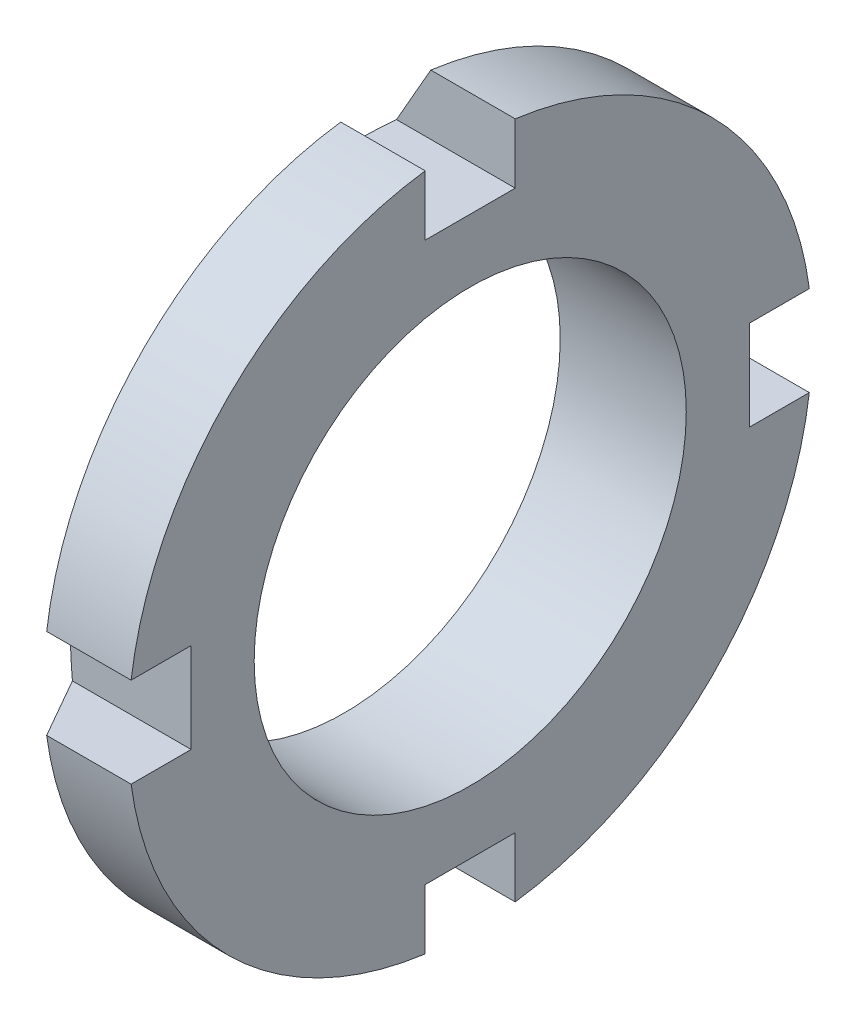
ISO-10303-21;
HEADER;
FILE_DESCRIPTION(('STEP AP214'),'2;1');
FILE_NAME('part.step','',(''),(''),'','','');
FILE_SCHEMA(('AUTOMOTIVE_DESIGN { 1 0 10303 214 1 1 1 1 }'));
ENDSEC;
DATA;
#1=APPLICATION_CONTEXT('core data for automotive mechanical design processes');
#2=APPLICATION_PROTOCOL_DEFINITION('international standard','automotive_design',2000,#1);
#3=PRODUCT_CONTEXT('',#1,'mechanical');
#4=PRODUCT('Part','Part','',(#3));
#5=PRODUCT_RELATED_PRODUCT_CATEGORY('part','',(#4));
#6=PRODUCT_DEFINITION_FORMATION('','',#4);
#7=PRODUCT_DEFINITION_CONTEXT('part definition',#1,'design');
#8=PRODUCT_DEFINITION('design','',#6,#7);
#9=PRODUCT_DEFINITION_SHAPE('','',#8);
#10=(LENGTH_UNIT() NAMED_UNIT(*) SI_UNIT(.MILLI.,.METRE.));
#11=(NAMED_UNIT(*) PLANE_ANGLE_UNIT() SI_UNIT($,.RADIAN.));
#12=(NAMED_UNIT(*) SI_UNIT($,.STERADIAN.) SOLID_ANGLE_UNIT());
#13=UNCERTAINTY_MEASURE_WITH_UNIT(LENGTH_MEASURE(1.E-05),#10,'distance_accuracy_value','');
#14=(GEOMETRIC_REPRESENTATION_CONTEXT(3) GLOBAL_UNCERTAINTY_ASSIGNED_CONTEXT((#13)) GLOBAL_UNIT_ASSIGNED_CONTEXT((#10,
#11,#12)) REPRESENTATION_CONTEXT('',''));
#15=CARTESIAN_POINT('',(0.,0.,0.));
#16=DIRECTION('',(0.,0.,1.));
#17=DIRECTION('',(1.,0.,0.));
#18=AXIS2_PLACEMENT_3D('',#15,#16,#17);
#19=CARTESIAN_POINT('',(-3.57298957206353,0.,0.));
#20=DIRECTION('',(-1.,0.,0.));
#21=DIRECTION('',(0.,0.,1.));
#22=AXIS2_PLACEMENT_3D('',#19,#20,#21);
#23=CYLINDRICAL_SURFACE('',#22,19.);
#24=CARTESIAN_POINT('',(2.30940107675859,0.,0.));
#25=DIRECTION('',(-1.,0.,0.));
#26=DIRECTION('',(0.,0.,1.));
#27=AXIS2_PLACEMENT_3D('',#24,#25,#26);
#28=CIRCLE('',#27,19.);
#29=CARTESIAN_POINT('',(2.30940107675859,-2.49999999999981,-18.8348082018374));
#30=VERTEX_POINT('',#29);
#31=CARTESIAN_POINT('',(2.30940107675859,-18.8348082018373,-2.50000000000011));
#32=VERTEX_POINT('',#31);
#33=EDGE_CURVE('E499',#30,#32,#28,.T.);
#34=ORIENTED_EDGE('',*,*,#33,.F.);
#35=DIRECTION('',(-1.,0.,0.));
#36=VECTOR('',#35,1.);
#37=CARTESIAN_POINT('',(-3.57298957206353,-2.49999999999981,-18.8348082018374));
#38=LINE('',#37,#36);
#39=CARTESIAN_POINT('',(6.9999999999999,-2.49999999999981,-18.8348082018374));
#40=VERTEX_POINT('',#39);
#41=EDGE_CURVE('E668',#30,#40,#38,.F.);
#42=ORIENTED_EDGE('',*,*,#41,.T.);
#43=CARTESIAN_POINT('',(6.9999999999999,0.,0.));
#44=DIRECTION('',(-1.,0.,0.));
#45=DIRECTION('',(0.,0.,1.));
#46=AXIS2_PLACEMENT_3D('',#43,#44,#45);
#47=CIRCLE('',#46,19.);
#48=CARTESIAN_POINT('',(6.9999999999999,-18.8348082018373,-2.50000000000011));
#49=VERTEX_POINT('',#48);
#50=EDGE_CURVE('E481',#40,#49,#47,.T.);
#51=ORIENTED_EDGE('',*,*,#50,.T.);
#52=DIRECTION('',(-1.,0.,0.));
#53=VECTOR('',#52,1.);
#54=CARTESIAN_POINT('',(-3.57298957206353,-18.8348082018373,-2.50000000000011));
#55=LINE('',#54,#53);
#56=EDGE_CURVE('E531',#49,#32,#55,.T.);
#57=ORIENTED_EDGE('',*,*,#56,.T.);
#58=EDGE_LOOP('',(#34,#42,#51,#57));
#59=FACE_BOUND('',#58,.T.);
#60=ADVANCED_FACE('F348',(#59),#23,.T.);
#61=CARTESIAN_POINT('',(2.30940107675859,-18.8348082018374,2.49999999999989));
#62=VERTEX_POINT('',#61);
#63=CARTESIAN_POINT('',(2.30940107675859,-2.50000000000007,18.8348082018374));
#64=VERTEX_POINT('',#63);
#65=EDGE_CURVE('E524',#62,#64,#28,.T.);
#66=ORIENTED_EDGE('',*,*,#65,.F.);
#67=DIRECTION('',(-1.,0.,0.));
#68=VECTOR('',#67,1.);
#69=CARTESIAN_POINT('',(-3.57298957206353,-18.8348082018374,2.49999999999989));
#70=LINE('',#69,#68);
#71=CARTESIAN_POINT('',(6.9999999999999,-18.8348082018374,2.49999999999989));
#72=VERTEX_POINT('',#71);
#73=EDGE_CURVE('E515',#62,#72,#70,.F.);
#74=ORIENTED_EDGE('',*,*,#73,.T.);
#75=CARTESIAN_POINT('',(6.9999999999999,-2.50000000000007,18.8348082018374));
#76=VERTEX_POINT('',#75);
#77=EDGE_CURVE('E486',#72,#76,#47,.T.);
#78=ORIENTED_EDGE('',*,*,#77,.T.);
#79=DIRECTION('',(-1.,0.,0.));
#80=VECTOR('',#79,1.);
#81=CARTESIAN_POINT('',(-3.57298957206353,-2.50000000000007,18.8348082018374));
#82=LINE('',#81,#80);
#83=EDGE_CURVE('E572',#76,#64,#82,.T.);
#84=ORIENTED_EDGE('',*,*,#83,.T.);
#85=EDGE_LOOP('',(#66,#74,#78,#84));
#86=FACE_BOUND('',#85,.T.);
#87=ADVANCED_FACE('F521',(#86),#23,.T.);
#88=CARTESIAN_POINT('',(2.30940107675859,2.49999999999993,18.8348082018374));
#89=VERTEX_POINT('',#88);
#90=CARTESIAN_POINT('',(2.30940107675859,18.8348082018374,2.5));
#91=VERTEX_POINT('',#90);
#92=EDGE_CURVE('E489',#89,#91,#28,.T.);
#93=ORIENTED_EDGE('',*,*,#92,.F.);
#94=DIRECTION('',(-1.,0.,0.));
#95=VECTOR('',#94,1.);
#96=CARTESIAN_POINT('',(-3.57298957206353,2.49999999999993,18.8348082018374));
#97=LINE('',#96,#95);
#98=CARTESIAN_POINT('',(6.9999999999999,2.49999999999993,18.8348082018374));
#99=VERTEX_POINT('',#98);
#100=EDGE_CURVE('E571',#89,#99,#97,.F.);
#101=ORIENTED_EDGE('',*,*,#100,.T.);
#102=CARTESIAN_POINT('',(6.9999999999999,18.8348082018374,2.5));
#103=VERTEX_POINT('',#102);
#104=EDGE_CURVE('E490',#99,#103,#47,.T.);
#105=ORIENTED_EDGE('',*,*,#104,.T.);
#106=DIRECTION('',(-1.,0.,0.));
#107=VECTOR('',#106,1.);
#108=CARTESIAN_POINT('',(-3.57298957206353,18.8348082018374,2.5));
#109=LINE('',#108,#107);
#110=EDGE_CURVE('E606',#103,#91,#109,.T.);
#111=ORIENTED_EDGE('',*,*,#110,.T.);
#112=EDGE_LOOP('',(#93,#101,#105,#111));
#113=FACE_BOUND('',#112,.T.);
#114=ADVANCED_FACE('F628',(#113),#23,.T.);
#115=CARTESIAN_POINT('',(0.,12.,0.));
#116=DIRECTION('',(1.,0.,0.));
#117=DIRECTION('',(0.,0.,-1.));
#118=AXIS2_PLACEMENT_3D('',#115,#116,#117);
#119=PLANE('',#118);
#120=CARTESIAN_POINT('',(0.,0.,0.));
#121=DIRECTION('',(-1.,0.,0.));
#122=DIRECTION('',(0.,0.,1.));
#123=AXIS2_PLACEMENT_3D('',#120,#121,#122);
#124=CIRCLE('',#123,12.);
#125=CARTESIAN_POINT('',(0.,0.,12.));
#126=VERTEX_POINT('',#125);
#127=EDGE_CURVE('E615',#126,#126,#124,.T.);
#128=ORIENTED_EDGE('',*,*,#127,.F.);
#129=EDGE_LOOP('',(#128));
#130=FACE_BOUND('',#129,.T.);
#131=CARTESIAN_POINT('',(0.,0.,0.));
#132=DIRECTION('',(-1.,0.,0.));
#133=DIRECTION('',(0.,0.,1.));
#134=AXIS2_PLACEMENT_3D('',#131,#132,#133);
#135=CIRCLE('',#134,15.);
#136=CARTESIAN_POINT('',(0.,0.,15.));
#137=VERTEX_POINT('',#136);
#138=EDGE_CURVE('E498',#137,#137,#135,.T.);
#139=ORIENTED_EDGE('',*,*,#138,.T.);
#140=EDGE_LOOP('',(#139));
#141=FACE_BOUND('',#140,.T.);
#142=ADVANCED_FACE('F350',(#130,#141),#119,.F.);
#143=CARTESIAN_POINT('',(2.30940107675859,0.,0.));
#144=DIRECTION('',(1.,0.,0.));
#145=DIRECTION('',(0.,0.,-1.));
#146=AXIS2_PLACEMENT_3D('',#143,#144,#145);
#147=CONICAL_SURFACE('',#146,19.,1.0471975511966);
#148=ORIENTED_EDGE('',*,*,#138,.F.);
#149=EDGE_LOOP('',(#148));
#150=FACE_BOUND('',#149,.T.);
#151=CARTESIAN_POINT('',(1.05418874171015,6.54684622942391,-15.4999999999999));
#152=CARTESIAN_POINT('',(0.975824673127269,6.19805511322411,-15.4999999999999));
#153=CARTESIAN_POINT('',(0.902530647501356,5.84809248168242,-15.4999999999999));
#154=CARTESIAN_POINT('',(0.767037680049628,5.14595160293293,-15.4999999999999));
#155=CARTESIAN_POINT('',(0.704841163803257,4.79377288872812,-15.4999999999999));
#156=CARTESIAN_POINT('',(0.592476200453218,4.0871207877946,-15.4999999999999));
#157=CARTESIAN_POINT('',(0.542320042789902,3.73264543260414,-15.5));
#158=CARTESIAN_POINT('',(0.45498476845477,3.02211636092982,-15.5));
#159=CARTESIAN_POINT('',(0.417804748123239,2.66606275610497,-15.5));
#160=CARTESIAN_POINT('',(0.357748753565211,1.960208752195,-15.5));
#161=CARTESIAN_POINT('',(0.334591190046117,1.61043243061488,-15.5));
#162=CARTESIAN_POINT('',(0.301828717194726,0.910239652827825,-15.5));
#163=CARTESIAN_POINT('',(0.292223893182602,0.559823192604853,-15.5));
#164=CARTESIAN_POINT('',(0.286760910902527,-0.140852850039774,-15.5));
#165=CARTESIAN_POINT('',(0.290892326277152,-0.491112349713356,-15.5));
#166=CARTESIAN_POINT('',(0.312793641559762,-1.19120638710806,-15.5));
#167=CARTESIAN_POINT('',(0.330563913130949,-1.54104091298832,-15.5));
#168=CARTESIAN_POINT('',(0.386982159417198,-2.34813505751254,-15.5));
#169=CARTESIAN_POINT('',(0.430395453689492,-2.80506675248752,-15.5));
#170=CARTESIAN_POINT('',(0.538704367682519,-3.71638025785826,-15.5));
#171=CARTESIAN_POINT('',(0.603601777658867,-4.17076185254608,-15.5));
#172=CARTESIAN_POINT('',(0.753162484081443,-5.07702202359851,-15.5));
#173=CARTESIAN_POINT('',(0.837858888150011,-5.52889509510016,-15.5));
#174=CARTESIAN_POINT('',(1.02488015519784,-6.42898557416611,-15.5000000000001));
#175=CARTESIAN_POINT('',(1.12720635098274,-6.87720270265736,-15.5000000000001));
#176=CARTESIAN_POINT('',(1.35055434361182,-7.78275908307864,-15.5000000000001));
#177=CARTESIAN_POINT('',(1.47203295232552,-8.23998500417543,-15.5000000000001));
#178=CARTESIAN_POINT('',(1.72921089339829,-9.15044068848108,-15.5000000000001));
#179=CARTESIAN_POINT('',(1.86491146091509,-9.60367010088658,-15.5000000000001));
#180=CARTESIAN_POINT('',(2.14792444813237,-10.5044053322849,-15.5000000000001));
#181=CARTESIAN_POINT('',(2.29518647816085,-10.9519270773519,-15.5000000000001));
#182=CARTESIAN_POINT('',(2.60007533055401,-11.84327625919,-15.5000000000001));
#183=CARTESIAN_POINT('',(2.7576988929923,-12.287104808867,-15.5000000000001));
#184=CARTESIAN_POINT('',(2.91968351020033,-12.7292914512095,-15.5000000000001));
#185=B_SPLINE_CURVE_WITH_KNOTS('',3,(#151,#152,#153,#154,#155,#156,#157,#158,#159,#160,#161,
#162,#163,#164,#165,#166,#167,#168,#169,#170,#171,#172,#173,#174,#175,#176,#177,#178,#179,#180,
#181,#182,#183,#184),.UNSPECIFIED.,.F.,.F.,(4,2,2,2,2,2,2,2,2,2,2,2,2,2,2,2,4),(0.,
1.07246701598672,2.14516815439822,3.21895957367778,4.29267619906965,5.34404683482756,
6.3954240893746,7.44600348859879,8.49661151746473,9.87300977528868,11.2495227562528,
12.6283542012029,14.0072899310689,15.4262900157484,16.8454134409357,18.2586627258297,
19.6714694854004),.UNSPECIFIED.);
#186=CARTESIAN_POINT('',(0.404329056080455,2.50000000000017,-15.5));
#187=VERTEX_POINT('',#186);
#188=CARTESIAN_POINT('',(0.404329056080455,-2.49999999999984,-15.5));
#189=VERTEX_POINT('',#188);
#190=EDGE_CURVE('E702',#187,#189,#185,.T.);
#191=ORIENTED_EDGE('',*,*,#190,.T.);
#192=CARTESIAN_POINT('',(-1.96133955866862,-2.49999999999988,-11.3303294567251));
#193=CARTESIAN_POINT('',(-1.79534850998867,-2.49999999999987,-11.6247419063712));
#194=CARTESIAN_POINT('',(-1.62913675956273,-2.49999999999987,-11.9190297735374));
#195=CARTESIAN_POINT('',(-1.29634518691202,-2.49999999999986,-12.5073971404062));
#196=CARTESIAN_POINT('',(-1.1297653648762,-2.49999999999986,-12.8014766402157));
#197=CARTESIAN_POINT('',(-0.629584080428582,-2.49999999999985,-13.6834632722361));
#198=CARTESIAN_POINT('',(-0.295540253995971,-2.49999999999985,-14.2711195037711));
#199=CARTESIAN_POINT('',(0.373358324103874,-2.49999999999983,-15.4459674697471));
#200=CARTESIAN_POINT('',(0.708213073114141,-2.49999999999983,-16.0331592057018));
#201=CARTESIAN_POINT('',(1.37851080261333,-2.49999999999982,-17.2072071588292));
#202=CARTESIAN_POINT('',(1.71395378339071,-2.49999999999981,-17.7940633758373));
#203=CARTESIAN_POINT('',(2.72092560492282,-2.4999999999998,-19.5542587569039));
#204=CARTESIAN_POINT('',(3.39309966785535,-2.49999999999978,-20.7272287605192));
#205=CARTESIAN_POINT('',(4.40212347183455,-2.49999999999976,-22.4862484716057));
#206=CARTESIAN_POINT('',(4.73859240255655,-2.49999999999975,-23.072516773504));
#207=CARTESIAN_POINT('',(5.41173910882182,-2.49999999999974,-24.2449333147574));
#208=CARTESIAN_POINT('',(5.74841688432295,-2.49999999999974,-24.8310815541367));
#209=CARTESIAN_POINT('',(6.08517663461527,-2.49999999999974,-25.4171827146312));
#210=B_SPLINE_CURVE_WITH_KNOTS('',3,(#192,#193,#194,#195,#196,#197,#198,#199,#200,#201,#202,
#203,#204,#205,#206,#207,#208,#209),.UNSPECIFIED.,.F.,.F.,(4,2,2,2,2,2,2,2,4),(0.,
1.01394520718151,2.02788989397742,4.05577593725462,6.08365534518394,8.11153574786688,
12.167282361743,14.1951622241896,16.2230416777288),.UNSPECIFIED.);
#211=EDGE_CURVE('E468',#189,#30,#210,.T.);
#212=ORIENTED_EDGE('',*,*,#211,.T.);
#213=ORIENTED_EDGE('',*,*,#33,.T.);
#214=CARTESIAN_POINT('',(6.0851766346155,-25.4171827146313,-2.50000000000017));
#215=CARTESIAN_POINT('',(5.7484168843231,-24.8310815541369,-2.50000000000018));
#216=CARTESIAN_POINT('',(5.41173910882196,-24.2449333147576,-2.50000000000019));
#217=CARTESIAN_POINT('',(4.73859240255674,-23.0725167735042,-2.50000000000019));
#218=CARTESIAN_POINT('',(4.40212347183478,-22.486248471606,-2.50000000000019));
#219=CARTESIAN_POINT('',(3.39309966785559,-20.7272287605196,-2.50000000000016));
#220=CARTESIAN_POINT('',(2.72092560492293,-19.5542587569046,-2.5000000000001));
#221=CARTESIAN_POINT('',(1.71395378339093,-17.7940633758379,-2.50000000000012));
#222=CARTESIAN_POINT('',(1.3785108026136,-17.2072071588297,-2.50000000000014));
#223=CARTESIAN_POINT('',(0.708213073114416,-16.0331592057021,-2.50000000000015));
#224=CARTESIAN_POINT('',(0.373358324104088,-15.4459674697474,-2.50000000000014));
#225=CARTESIAN_POINT('',(-0.295540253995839,-14.2711195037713,-2.50000000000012));
#226=CARTESIAN_POINT('',(-0.629584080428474,-13.6834632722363,-2.50000000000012));
#227=CARTESIAN_POINT('',(-1.12976536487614,-12.8014766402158,-2.50000000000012));
#228=CARTESIAN_POINT('',(-1.29634518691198,-12.5073971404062,-2.50000000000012));
#229=CARTESIAN_POINT('',(-1.62913675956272,-11.9190297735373,-2.5000000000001));
#230=CARTESIAN_POINT('',(-1.79534850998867,-11.6247419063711,-2.50000000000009));
#231=CARTESIAN_POINT('',(-1.96133955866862,-11.330329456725,-2.50000000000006));
#232=B_SPLINE_CURVE_WITH_KNOTS('',3,(#214,#215,#216,#217,#218,#219,#220,#221,#222,#223,#224,
#225,#226,#227,#228,#229,#230,#231),.UNSPECIFIED.,.F.,.F.,(4,2,2,2,2,2,2,2,4),(0.,
2.02787945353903,4.05575931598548,8.11150592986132,10.1393863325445,12.167265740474,
14.1951517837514,15.2090964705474,16.223041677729),.UNSPECIFIED.);
#233=CARTESIAN_POINT('',(0.404329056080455,-15.5,-2.50000000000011));
#234=VERTEX_POINT('',#233);
#235=EDGE_CURVE('E526',#32,#234,#232,.T.);
#236=ORIENTED_EDGE('',*,*,#235,.T.);
#237=CARTESIAN_POINT('',(2.91968351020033,-15.4999999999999,-12.7292914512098));
#238=CARTESIAN_POINT('',(2.7576988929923,-15.4999999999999,-12.2871048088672));
#239=CARTESIAN_POINT('',(2.600075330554,-15.4999999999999,-11.8432762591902));
#240=CARTESIAN_POINT('',(2.29518647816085,-15.4999999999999,-10.9519270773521));
#241=CARTESIAN_POINT('',(2.14792444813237,-15.4999999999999,-10.5044053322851));
#242=CARTESIAN_POINT('',(1.86491146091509,-15.4999999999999,-9.60367010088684));
#243=CARTESIAN_POINT('',(1.7292108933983,-15.4999999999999,-9.15044068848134));
#244=CARTESIAN_POINT('',(1.47203295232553,-15.4999999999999,-8.2399850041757));
#245=CARTESIAN_POINT('',(1.35055434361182,-15.4999999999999,-7.78275908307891));
#246=CARTESIAN_POINT('',(1.12720635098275,-15.4999999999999,-6.87720270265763));
#247=CARTESIAN_POINT('',(1.02488015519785,-15.5,-6.42898557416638));
#248=CARTESIAN_POINT('',(0.837858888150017,-15.5,-5.52889509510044));
#249=CARTESIAN_POINT('',(0.753162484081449,-15.5,-5.07702202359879));
#250=CARTESIAN_POINT('',(0.603601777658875,-15.5,-4.17076185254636));
#251=CARTESIAN_POINT('',(0.53870436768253,-15.5,-3.71638025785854));
#252=CARTESIAN_POINT('',(0.430395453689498,-15.5,-2.80506675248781));
#253=CARTESIAN_POINT('',(0.386982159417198,-15.5,-2.34813505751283));
#254=CARTESIAN_POINT('',(0.330563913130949,-15.5,-1.54104091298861));
#255=CARTESIAN_POINT('',(0.312793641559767,-15.5,-1.19120638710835));
#256=CARTESIAN_POINT('',(0.290892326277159,-15.5,-0.491112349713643));
#257=CARTESIAN_POINT('',(0.286760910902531,-15.5,-0.140852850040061));
#258=CARTESIAN_POINT('',(0.292223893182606,-15.5,0.559823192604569));
#259=CARTESIAN_POINT('',(0.30182871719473,-15.5,0.910239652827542));
#260=CARTESIAN_POINT('',(0.334591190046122,-15.5,1.6104324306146));
#261=CARTESIAN_POINT('',(0.357748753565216,-15.5,1.96020875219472));
#262=CARTESIAN_POINT('',(0.417804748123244,-15.5,2.6660627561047));
#263=CARTESIAN_POINT('',(0.454984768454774,-15.5,3.02211636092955));
#264=CARTESIAN_POINT('',(0.542320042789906,-15.5,3.73264543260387));
#265=CARTESIAN_POINT('',(0.592476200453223,-15.5,4.08712078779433));
#266=CARTESIAN_POINT('',(0.704841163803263,-15.5,4.79377288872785));
#267=CARTESIAN_POINT('',(0.767037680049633,-15.5,5.14595160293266));
#268=CARTESIAN_POINT('',(0.902530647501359,-15.5,5.84809248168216));
#269=CARTESIAN_POINT('',(0.97582467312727,-15.5,6.19805511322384));
#270=CARTESIAN_POINT('',(1.05418874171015,-15.5,6.54684622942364));
#271=B_SPLINE_CURVE_WITH_KNOTS('',3,(#237,#238,#239,#240,#241,#242,#243,#244,#245,#246,#247,
#248,#249,#250,#251,#252,#253,#254,#255,#256,#257,#258,#259,#260,#261,#262,#263,#264,#265,#266,
#267,#268,#269,#270),.UNSPECIFIED.,.F.,.F.,(4,2,2,2,2,2,2,2,2,2,2,2,2,2,2,2,4),(0.,
1.41280675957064,2.82605604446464,4.24517946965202,5.66417955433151,7.04311528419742,
8.42194672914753,9.79845971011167,11.1748579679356,12.2254659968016,13.2760453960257,
14.3274226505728,15.3787932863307,16.4525099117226,17.5263013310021,18.5990024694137,
19.6714694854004),.UNSPECIFIED.);
#272=CARTESIAN_POINT('',(0.404329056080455,-15.5,2.49999999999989));
#273=VERTEX_POINT('',#272);
#274=EDGE_CURVE('E653',#234,#273,#271,.T.);
#275=ORIENTED_EDGE('',*,*,#274,.T.);
#276=CARTESIAN_POINT('',(-1.96133955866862,-11.3303294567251,2.49999999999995));
#277=CARTESIAN_POINT('',(-1.79534850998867,-11.6247419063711,2.49999999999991));
#278=CARTESIAN_POINT('',(-1.62913675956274,-11.9190297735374,2.4999999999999));
#279=CARTESIAN_POINT('',(-1.29634518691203,-12.5073971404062,2.49999999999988));
#280=CARTESIAN_POINT('',(-1.12976536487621,-12.8014766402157,2.49999999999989));
#281=CARTESIAN_POINT('',(-0.629584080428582,-13.6834632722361,2.49999999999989));
#282=CARTESIAN_POINT('',(-0.295540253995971,-14.2711195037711,2.49999999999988));
#283=CARTESIAN_POINT('',(0.373358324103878,-15.4459674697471,2.49999999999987));
#284=CARTESIAN_POINT('',(0.708213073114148,-16.0331592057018,2.49999999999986));
#285=CARTESIAN_POINT('',(1.37851080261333,-17.2072071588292,2.49999999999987));
#286=CARTESIAN_POINT('',(1.71395378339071,-17.7940633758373,2.49999999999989));
#287=CARTESIAN_POINT('',(2.72092560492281,-19.554258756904,2.4999999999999));
#288=CARTESIAN_POINT('',(3.39309966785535,-20.7272287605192,2.49999999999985));
#289=CARTESIAN_POINT('',(4.40212347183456,-22.4862484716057,2.49999999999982));
#290=CARTESIAN_POINT('',(4.73859240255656,-23.072516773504,2.49999999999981));
#291=CARTESIAN_POINT('',(5.41173910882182,-24.2449333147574,2.49999999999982));
#292=CARTESIAN_POINT('',(5.74841688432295,-24.8310815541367,2.49999999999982));
#293=CARTESIAN_POINT('',(6.08517663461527,-25.4171827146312,2.49999999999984));
#294=B_SPLINE_CURVE_WITH_KNOTS('',3,(#276,#277,#278,#279,#280,#281,#282,#283,#284,#285,#286,
#287,#288,#289,#290,#291,#292,#293),.UNSPECIFIED.,.F.,.F.,(4,2,2,2,2,2,2,2,4),(0.,
1.01394520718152,2.02788989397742,4.05577593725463,6.08365534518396,8.1115357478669,
12.167282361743,14.1951622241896,16.2230416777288),.UNSPECIFIED.);
#295=EDGE_CURVE('E525',#273,#62,#294,.T.);
#296=ORIENTED_EDGE('',*,*,#295,.T.);
#297=ORIENTED_EDGE('',*,*,#65,.T.);
#298=CARTESIAN_POINT('',(4.66499149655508,-2.50000000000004,22.9442041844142));
#299=CARTESIAN_POINT('',(4.32850937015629,-2.50000000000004,22.3579409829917));
#300=CARTESIAN_POINT('',(3.99213311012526,-2.50000000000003,21.7716169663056));
#301=CARTESIAN_POINT('',(3.31967111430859,-2.50000000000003,20.5988022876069));
#302=CARTESIAN_POINT('',(2.98358537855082,-2.50000000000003,20.0123116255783));
#303=CARTESIAN_POINT('',(2.31178615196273,-2.50000000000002,18.839123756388));
#304=CARTESIAN_POINT('',(1.97607265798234,-2.50000000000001,18.2524265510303));
#305=CARTESIAN_POINT('',(1.30513555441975,-2.50000000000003,17.0787514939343));
#306=CARTESIAN_POINT('',(0.96991194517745,-2.50000000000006,16.4917736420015));
#307=CARTESIAN_POINT('',(0.300128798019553,-2.50000000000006,15.3174312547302));
#308=CARTESIAN_POINT('',(-0.0344307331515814,-2.50000000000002,14.7300667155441));
#309=CARTESIAN_POINT('',(-0.702611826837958,-2.49999999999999,13.5548053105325));
#310=CARTESIAN_POINT('',(-1.03623339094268,-2.5,12.9669084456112));
#311=CARTESIAN_POINT('',(-1.53562405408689,-2.5,12.0844698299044));
#312=CARTESIAN_POINT('',(-1.70191479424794,-2.5,11.7902233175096));
#313=CARTESIAN_POINT('',(-2.03406011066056,-2.5,11.2014844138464));
#314=CARTESIAN_POINT('',(-2.19991468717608,-2.5,10.906992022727));
#315=CARTESIAN_POINT('',(-2.5310802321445,-2.49999999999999,10.317699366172));
#316=CARTESIAN_POINT('',(-2.69639119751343,-2.49999999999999,10.0228990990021));
#317=CARTESIAN_POINT('',(-3.02629984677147,-2.5,9.43289900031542));
#318=CARTESIAN_POINT('',(-3.19089752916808,-2.5,9.1376991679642));
#319=CARTESIAN_POINT('',(-3.35505385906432,-2.50000000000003,8.84225349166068));
#320=B_SPLINE_CURVE_WITH_KNOTS('',3,(#298,#299,#300,#301,#302,#303,#304,#305,#306,#307,#308,
#309,#310,#311,#312,#313,#314,#315,#316,#317,#318,#319),.UNSPECIFIED.,.F.,.F.,(4,2,2,2,2,2,2,2,
2,2,4),(0.,2.02788636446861,4.05577292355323,6.0836421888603,8.11151286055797,10.1394040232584,
12.1672917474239,13.181245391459,14.1951984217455,15.2091571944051,16.2231180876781),.UNSPECIFIED.);
#321=CARTESIAN_POINT('',(0.404329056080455,-2.50000000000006,15.5));
#322=VERTEX_POINT('',#321);
#323=EDGE_CURVE('E564',#64,#322,#320,.T.);
#324=ORIENTED_EDGE('',*,*,#323,.T.);
#325=CARTESIAN_POINT('',(2.91968351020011,-12.7292914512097,15.5));
#326=CARTESIAN_POINT('',(2.75769889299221,-12.2871048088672,15.5));
#327=CARTESIAN_POINT('',(2.60007533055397,-11.8432762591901,15.5));
#328=CARTESIAN_POINT('',(2.29518647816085,-10.951927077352,15.5));
#329=CARTESIAN_POINT('',(2.14792444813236,-10.504405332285,15.5));
#330=CARTESIAN_POINT('',(1.86491146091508,-9.60367010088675,15.5));
#331=CARTESIAN_POINT('',(1.72921089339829,-9.15044068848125,15.5));
#332=CARTESIAN_POINT('',(1.47203295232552,-8.23998500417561,15.5));
#333=CARTESIAN_POINT('',(1.35055434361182,-7.78275908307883,15.5));
#334=CARTESIAN_POINT('',(1.12720635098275,-6.87720270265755,15.5));
#335=CARTESIAN_POINT('',(1.02488015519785,-6.4289855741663,15.5));
#336=CARTESIAN_POINT('',(0.837858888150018,-5.52889509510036,15.5));
#337=CARTESIAN_POINT('',(0.753162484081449,-5.07702202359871,15.5));
#338=CARTESIAN_POINT('',(0.603601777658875,-4.17076185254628,15.5));
#339=CARTESIAN_POINT('',(0.538704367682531,-3.71638025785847,15.5));
#340=CARTESIAN_POINT('',(0.430395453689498,-2.80506675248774,15.5));
#341=CARTESIAN_POINT('',(0.386982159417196,-2.34813505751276,15.5));
#342=CARTESIAN_POINT('',(0.33056391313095,-1.54104091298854,15.5));
#343=CARTESIAN_POINT('',(0.31279364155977,-1.19120638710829,15.5));
#344=CARTESIAN_POINT('',(0.290892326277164,-0.491112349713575,15.5));
#345=CARTESIAN_POINT('',(0.286760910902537,-0.140852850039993,15.5));
#346=CARTESIAN_POINT('',(0.292223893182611,0.559823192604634,15.5));
#347=CARTESIAN_POINT('',(0.301828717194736,0.910239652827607,15.5));
#348=CARTESIAN_POINT('',(0.334591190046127,1.61043243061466,15.5));
#349=CARTESIAN_POINT('',(0.357748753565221,1.96020875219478,15.5));
#350=CARTESIAN_POINT('',(0.417804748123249,2.66606275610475,15.5));
#351=CARTESIAN_POINT('',(0.454984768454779,3.0221163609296,15.5));
#352=CARTESIAN_POINT('',(0.54232004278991,3.73264543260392,15.5));
#353=CARTESIAN_POINT('',(0.592476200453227,4.08712078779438,15.5));
#354=CARTESIAN_POINT('',(0.704841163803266,4.7937728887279,15.5));
#355=CARTESIAN_POINT('',(0.767037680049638,5.14595160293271,15.5));
#356=CARTESIAN_POINT('',(0.902530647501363,5.8480924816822,15.5));
#357=CARTESIAN_POINT('',(0.975824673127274,6.19805511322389,15.5));
#358=CARTESIAN_POINT('',(1.05418874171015,6.54684622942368,15.5));
#359=B_SPLINE_CURVE_WITH_KNOTS('',3,(#325,#326,#327,#328,#329,#330,#331,#332,#333,#334,#335,
#336,#337,#338,#339,#340,#341,#342,#343,#344,#345,#346,#347,#348,#349,#350,#351,#352,#353,#354,
#355,#356,#357,#358),.UNSPECIFIED.,.F.,.F.,(4,2,2,2,2,2,2,2,2,2,2,2,2,2,2,2,4),(0.,
1.41280675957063,2.82605604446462,4.24517946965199,5.66417955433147,7.04311528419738,
8.42194672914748,9.79845971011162,11.1748579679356,12.2254659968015,13.2760453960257,
14.3274226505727,15.3787932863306,16.4525099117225,17.5263013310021,18.5990024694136,
19.6714694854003),.UNSPECIFIED.);
#360=CARTESIAN_POINT('',(0.404329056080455,2.49999999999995,15.5));
#361=VERTEX_POINT('',#360);
#362=EDGE_CURVE('E756',#322,#361,#359,.T.);
#363=ORIENTED_EDGE('',*,*,#362,.T.);
#364=CARTESIAN_POINT('',(-3.35505385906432,2.49999999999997,8.84225349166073));
#365=CARTESIAN_POINT('',(-3.19089752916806,2.5,9.13769916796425));
#366=CARTESIAN_POINT('',(-3.02629984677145,2.50000000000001,9.43289900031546));
#367=CARTESIAN_POINT('',(-2.6963911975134,2.50000000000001,10.0228990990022));
#368=CARTESIAN_POINT('',(-2.53108023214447,2.50000000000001,10.317699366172));
#369=CARTESIAN_POINT('',(-2.19991468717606,2.50000000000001,10.9069920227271));
#370=CARTESIAN_POINT('',(-2.03406011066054,2.50000000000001,11.2014844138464));
#371=CARTESIAN_POINT('',(-1.70191479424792,2.5,11.7902233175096));
#372=CARTESIAN_POINT('',(-1.53562405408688,2.5,12.0844698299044));
#373=CARTESIAN_POINT('',(-1.03623339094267,2.5,12.9669084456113));
#374=CARTESIAN_POINT('',(-0.702611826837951,2.50000000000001,13.5548053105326));
#375=CARTESIAN_POINT('',(-0.0344307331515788,2.49999999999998,14.7300667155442));
#376=CARTESIAN_POINT('',(0.300128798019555,2.49999999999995,15.3174312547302));
#377=CARTESIAN_POINT('',(0.96991194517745,2.49999999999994,16.4917736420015));
#378=CARTESIAN_POINT('',(1.30513555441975,2.49999999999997,17.0787514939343));
#379=CARTESIAN_POINT('',(1.97607265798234,2.49999999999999,18.2524265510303));
#380=CARTESIAN_POINT('',(2.31178615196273,2.49999999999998,18.839123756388));
#381=CARTESIAN_POINT('',(2.98358537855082,2.49999999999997,20.0123116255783));
#382=CARTESIAN_POINT('',(3.31967111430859,2.49999999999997,20.5988022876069));
#383=CARTESIAN_POINT('',(3.99213311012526,2.49999999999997,21.7716169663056));
#384=CARTESIAN_POINT('',(4.32850937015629,2.49999999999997,22.3579409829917));
#385=CARTESIAN_POINT('',(4.66499149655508,2.49999999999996,22.9442041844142));
#386=B_SPLINE_CURVE_WITH_KNOTS('',3,(#364,#365,#366,#367,#368,#369,#370,#371,#372,#373,#374,
#375,#376,#377,#378,#379,#380,#381,#382,#383,#384,#385),.UNSPECIFIED.,.F.,.F.,(4,2,2,2,2,2,2,2,
2,2,4),(0.,1.01396089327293,2.02791966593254,3.04187269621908,4.05582634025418,6.08371406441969,
8.11160522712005,10.1394758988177,12.1673451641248,14.1952317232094,16.223118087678),.UNSPECIFIED.);
#387=EDGE_CURVE('E576',#361,#89,#386,.T.);
#388=ORIENTED_EDGE('',*,*,#387,.T.);
#389=ORIENTED_EDGE('',*,*,#92,.T.);
#390=CARTESIAN_POINT('',(4.66499149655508,22.9442041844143,2.5));
#391=CARTESIAN_POINT('',(4.3285093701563,22.3579409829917,2.5));
#392=CARTESIAN_POINT('',(3.99213311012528,21.7716169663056,2.5));
#393=CARTESIAN_POINT('',(3.3196711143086,20.5988022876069,2.5));
#394=CARTESIAN_POINT('',(2.98358537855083,20.0123116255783,2.5));
#395=CARTESIAN_POINT('',(2.31178615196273,18.839123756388,2.5));
#396=CARTESIAN_POINT('',(1.97607265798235,18.2524265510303,2.5));
#397=CARTESIAN_POINT('',(1.30513555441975,17.0787514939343,2.5));
#398=CARTESIAN_POINT('',(0.969911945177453,16.4917736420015,2.5));
#399=CARTESIAN_POINT('',(0.300128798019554,15.3174312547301,2.5));
#400=CARTESIAN_POINT('',(-0.0344307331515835,14.7300667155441,2.5));
#401=CARTESIAN_POINT('',(-0.70261182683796,13.5548053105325,2.5));
#402=CARTESIAN_POINT('',(-1.03623339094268,12.9669084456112,2.5));
#403=CARTESIAN_POINT('',(-1.53562405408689,12.0844698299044,2.5));
#404=CARTESIAN_POINT('',(-1.70191479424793,11.7902233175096,2.5));
#405=CARTESIAN_POINT('',(-2.03406011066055,11.2014844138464,2.5));
#406=CARTESIAN_POINT('',(-2.19991468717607,10.906992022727,2.5));
#407=CARTESIAN_POINT('',(-2.53108023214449,10.317699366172,2.5));
#408=CARTESIAN_POINT('',(-2.69639119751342,10.0228990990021,2.5));
#409=CARTESIAN_POINT('',(-3.02629984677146,9.43289900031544,2.5));
#410=CARTESIAN_POINT('',(-3.19089752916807,9.13769916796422,2.5));
#411=CARTESIAN_POINT('',(-3.35505385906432,8.84225349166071,2.5));
#412=B_SPLINE_CURVE_WITH_KNOTS('',3,(#390,#391,#392,#393,#394,#395,#396,#397,#398,#399,#400,
#401,#402,#403,#404,#405,#406,#407,#408,#409,#410,#411),.UNSPECIFIED.,.F.,.F.,(4,2,2,2,2,2,2,2,
2,2,4),(0.,2.02788636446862,4.05577292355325,6.08364218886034,8.11151286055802,10.1394040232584,
12.1672917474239,13.181245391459,14.1951984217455,15.2091571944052,16.2231180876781),.UNSPECIFIED.);
#413=CARTESIAN_POINT('',(0.404329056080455,15.5,2.5));
#414=VERTEX_POINT('',#413);
#415=EDGE_CURVE('E598',#91,#414,#412,.T.);
#416=ORIENTED_EDGE('',*,*,#415,.T.);
#417=CARTESIAN_POINT('',(1.05418874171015,15.5,6.54684622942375));
#418=CARTESIAN_POINT('',(0.975824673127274,15.5,6.19805511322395));
#419=CARTESIAN_POINT('',(0.902530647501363,15.5,5.84809248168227));
#420=CARTESIAN_POINT('',(0.767037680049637,15.5,5.14595160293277));
#421=CARTESIAN_POINT('',(0.704841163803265,15.5,4.79377288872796));
#422=CARTESIAN_POINT('',(0.592476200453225,15.5,4.08712078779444));
#423=CARTESIAN_POINT('',(0.542320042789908,15.5,3.73264543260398));
#424=CARTESIAN_POINT('',(0.454984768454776,15.5,3.02211636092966));
#425=CARTESIAN_POINT('',(0.417804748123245,15.5,2.66606275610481));
#426=CARTESIAN_POINT('',(0.357748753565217,15.5,1.96020875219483));
#427=CARTESIAN_POINT('',(0.334591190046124,15.5,1.61043243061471));
#428=CARTESIAN_POINT('',(0.301828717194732,15.5,0.910239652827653));
#429=CARTESIAN_POINT('',(0.292223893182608,15.5,0.55982319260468));
#430=CARTESIAN_POINT('',(0.286760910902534,15.5,-0.140852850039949));
#431=CARTESIAN_POINT('',(0.290892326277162,15.5,-0.491112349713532));
#432=CARTESIAN_POINT('',(0.312793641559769,15.5,-1.19120638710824));
#433=CARTESIAN_POINT('',(0.33056391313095,15.5,-1.5410409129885));
#434=CARTESIAN_POINT('',(0.386982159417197,15.5,-2.34813505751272));
#435=CARTESIAN_POINT('',(0.430395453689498,15.5,-2.8050667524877));
#436=CARTESIAN_POINT('',(0.538704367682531,15.5,-3.71638025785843));
#437=CARTESIAN_POINT('',(0.603601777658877,15.5,-4.17076185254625));
#438=CARTESIAN_POINT('',(0.753162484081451,15.5,-5.07702202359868));
#439=CARTESIAN_POINT('',(0.837858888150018,15.5,-5.52889509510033));
#440=CARTESIAN_POINT('',(1.02488015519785,15.5,-6.42898557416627));
#441=CARTESIAN_POINT('',(1.12720635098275,15.5,-6.87720270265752));
#442=CARTESIAN_POINT('',(1.35055434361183,15.5,-7.7827590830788));
#443=CARTESIAN_POINT('',(1.47203295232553,15.5,-8.23998500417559));
#444=CARTESIAN_POINT('',(1.7292108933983,15.5,-9.15044068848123));
#445=CARTESIAN_POINT('',(1.86491146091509,15.5,-9.60367010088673));
#446=CARTESIAN_POINT('',(2.14792444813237,15.5,-10.504405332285));
#447=CARTESIAN_POINT('',(2.29518647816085,15.5,-10.951927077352));
#448=CARTESIAN_POINT('',(2.600075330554,15.5,-11.8432762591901));
#449=CARTESIAN_POINT('',(2.7576988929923,15.5,-12.2871048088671));
#450=CARTESIAN_POINT('',(2.91968351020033,15.5,-12.7292914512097));
#451=B_SPLINE_CURVE_WITH_KNOTS('',3,(#417,#418,#419,#420,#421,#422,#423,#424,#425,#426,#427,
#428,#429,#430,#431,#432,#433,#434,#435,#436,#437,#438,#439,#440,#441,#442,#443,#444,#445,#446,
#447,#448,#449,#450),.UNSPECIFIED.,.F.,.F.,(4,2,2,2,2,2,2,2,2,2,2,2,2,2,2,2,4),(0.,
1.07246701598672,2.14516815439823,3.21895957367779,4.29267619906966,5.34404683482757,
6.39542408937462,7.44600348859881,8.49661151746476,9.8730097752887,11.2495227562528,
12.628354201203,14.0072899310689,15.4262900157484,16.8454134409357,18.2586627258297,
19.6714694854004),.UNSPECIFIED.);
#452=CARTESIAN_POINT('',(0.404329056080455,15.5,-2.5));
#453=VERTEX_POINT('',#452);
#454=EDGE_CURVE('E712',#414,#453,#451,.T.);
#455=ORIENTED_EDGE('',*,*,#454,.T.);
#456=CARTESIAN_POINT('',(-3.35505385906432,8.84225349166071,-2.5));
#457=CARTESIAN_POINT('',(-3.19089752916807,9.13769916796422,-2.5));
#458=CARTESIAN_POINT('',(-3.02629984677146,9.43289900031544,-2.5));
#459=CARTESIAN_POINT('',(-2.69639119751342,10.0228990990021,-2.5));
#460=CARTESIAN_POINT('',(-2.53108023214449,10.317699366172,-2.5));
#461=CARTESIAN_POINT('',(-2.19991468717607,10.906992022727,-2.5));
#462=CARTESIAN_POINT('',(-2.03406011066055,11.2014844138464,-2.5));
#463=CARTESIAN_POINT('',(-1.70191479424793,11.7902233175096,-2.5));
#464=CARTESIAN_POINT('',(-1.53562405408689,12.0844698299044,-2.5));
#465=CARTESIAN_POINT('',(-1.03623339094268,12.9669084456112,-2.5));
#466=CARTESIAN_POINT('',(-0.70261182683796,13.5548053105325,-2.5));
#467=CARTESIAN_POINT('',(-0.034430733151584,14.7300667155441,-2.5));
#468=CARTESIAN_POINT('',(0.300128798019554,15.3174312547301,-2.5));
#469=CARTESIAN_POINT('',(0.969911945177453,16.4917736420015,-2.5));
#470=CARTESIAN_POINT('',(1.30513555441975,17.0787514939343,-2.5));
#471=CARTESIAN_POINT('',(1.97607265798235,18.2524265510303,-2.5));
#472=CARTESIAN_POINT('',(2.31178615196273,18.839123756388,-2.5));
#473=CARTESIAN_POINT('',(2.98358537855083,20.0123116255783,-2.5));
#474=CARTESIAN_POINT('',(3.3196711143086,20.5988022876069,-2.5));
#475=CARTESIAN_POINT('',(3.99213311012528,21.7716169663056,-2.5));
#476=CARTESIAN_POINT('',(4.3285093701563,22.3579409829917,-2.5));
#477=CARTESIAN_POINT('',(4.66499149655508,22.9442041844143,-2.5));
#478=B_SPLINE_CURVE_WITH_KNOTS('',3,(#456,#457,#458,#459,#460,#461,#462,#463,#464,#465,#466,
#467,#468,#469,#470,#471,#472,#473,#474,#475,#476,#477),.UNSPECIFIED.,.F.,.F.,(4,2,2,2,2,2,2,2,
2,2,4),(0.,1.01396089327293,2.02791966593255,3.04187269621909,4.05582634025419,6.0837140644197,
8.11160522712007,10.1394758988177,12.1673451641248,14.1952317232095,16.2231180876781),.UNSPECIFIED.);
#479=CARTESIAN_POINT('',(2.30940107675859,18.8348082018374,-2.5));
#480=VERTEX_POINT('',#479);
#481=EDGE_CURVE('E610',#453,#480,#478,.T.);
#482=ORIENTED_EDGE('',*,*,#481,.T.);
#483=CARTESIAN_POINT('',(2.30940107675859,2.5000000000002,-18.8348082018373));
#484=VERTEX_POINT('',#483);
#485=EDGE_CURVE('E495',#480,#484,#28,.T.);
#486=ORIENTED_EDGE('',*,*,#485,.T.);
#487=CARTESIAN_POINT('',(6.0851766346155,2.50000000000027,-25.4171827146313));
#488=CARTESIAN_POINT('',(5.7484168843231,2.50000000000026,-24.8310815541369));
#489=CARTESIAN_POINT('',(5.41173910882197,2.50000000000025,-24.2449333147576));
#490=CARTESIAN_POINT('',(4.73859240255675,2.50000000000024,-23.0725167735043));
#491=CARTESIAN_POINT('',(4.40212347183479,2.50000000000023,-22.4862484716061));
#492=CARTESIAN_POINT('',(3.3930996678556,2.50000000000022,-20.7272287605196));
#493=CARTESIAN_POINT('',(2.72092560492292,2.50000000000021,-19.5542587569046));
#494=CARTESIAN_POINT('',(1.71395378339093,2.50000000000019,-17.7940633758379));
#495=CARTESIAN_POINT('',(1.37851080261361,2.50000000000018,-17.2072071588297));
#496=CARTESIAN_POINT('',(0.708213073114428,2.50000000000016,-16.0331592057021));
#497=CARTESIAN_POINT('',(0.373358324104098,2.50000000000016,-15.4459674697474));
#498=CARTESIAN_POINT('',(-0.295540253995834,2.50000000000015,-14.2711195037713));
#499=CARTESIAN_POINT('',(-0.62958408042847,2.50000000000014,-13.6834632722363));
#500=CARTESIAN_POINT('',(-1.12976536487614,2.50000000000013,-12.8014766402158));
#501=CARTESIAN_POINT('',(-1.29634518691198,2.50000000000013,-12.5073971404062));
#502=CARTESIAN_POINT('',(-1.62913675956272,2.50000000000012,-11.9190297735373));
#503=CARTESIAN_POINT('',(-1.79534850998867,2.50000000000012,-11.6247419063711));
#504=CARTESIAN_POINT('',(-1.96133955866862,2.50000000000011,-11.330329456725));
#505=B_SPLINE_CURVE_WITH_KNOTS('',3,(#487,#488,#489,#490,#491,#492,#493,#494,#495,#496,#497,
#498,#499,#500,#501,#502,#503,#504),.UNSPECIFIED.,.F.,.F.,(4,2,2,2,2,2,2,2,4),(0.,
2.02787945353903,4.05575931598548,8.11150592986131,10.1393863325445,12.167265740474,
14.1951517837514,15.2090964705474,16.223041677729),.UNSPECIFIED.);
#506=EDGE_CURVE('E693',#484,#187,#505,.T.);
#507=ORIENTED_EDGE('',*,*,#506,.T.);
#508=EDGE_LOOP('',(#191,#212,#213,#236,#275,#296,#297,#324,#363,#388,#389,#416,#455,#482,#486,#507));
#509=FACE_BOUND('',#508,.T.);
#510=ADVANCED_FACE('F544',(#150,#509),#147,.T.);
#511=CARTESIAN_POINT('',(6.9999999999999,18.8348082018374,-2.5));
#512=VERTEX_POINT('',#511);
#513=CARTESIAN_POINT('',(6.9999999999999,2.5000000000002,-18.8348082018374));
#514=VERTEX_POINT('',#513);
#515=EDGE_CURVE('E485',#512,#514,#47,.T.);
#516=ORIENTED_EDGE('',*,*,#515,.T.);
#517=DIRECTION('',(-1.,0.,0.));
#518=VECTOR('',#517,1.);
#519=CARTESIAN_POINT('',(-3.57298957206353,2.5000000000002,-18.8348082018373));
#520=LINE('',#519,#518);
#521=EDGE_CURVE('E699',#514,#484,#520,.T.);
#522=ORIENTED_EDGE('',*,*,#521,.T.);
#523=ORIENTED_EDGE('',*,*,#485,.F.);
#524=DIRECTION('',(-1.,0.,0.));
#525=VECTOR('',#524,1.);
#526=CARTESIAN_POINT('',(-3.57298957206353,18.8348082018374,-2.5));
#527=LINE('',#526,#525);
#528=EDGE_CURVE('E605',#480,#512,#527,.F.);
#529=ORIENTED_EDGE('',*,*,#528,.T.);
#530=EDGE_LOOP('',(#516,#522,#523,#529));
#531=FACE_BOUND('',#530,.T.);
#532=ADVANCED_FACE('F625',(#531),#23,.T.);
#533=CARTESIAN_POINT('',(6.9999999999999,19.,0.));
#534=DIRECTION('',(-1.,0.,0.));
#535=DIRECTION('',(0.,0.,1.));
#536=AXIS2_PLACEMENT_3D('',#533,#534,#535);
#537=PLANE('',#536);
#538=ORIENTED_EDGE('',*,*,#50,.F.);
#539=DIRECTION('',(0.,0.,1.));
#540=VECTOR('',#539,1.);
#541=CARTESIAN_POINT('',(6.9999999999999,-2.5,-2.22044604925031E-13));
#542=LINE('',#541,#540);
#543=CARTESIAN_POINT('',(6.9999999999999,-2.49999999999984,-15.5));
#544=VERTEX_POINT('',#543);
#545=EDGE_CURVE('E11',#40,#544,#542,.T.);
#546=ORIENTED_EDGE('',*,*,#545,.T.);
#547=DIRECTION('',(0.,1.,0.));
#548=VECTOR('',#547,1.);
#549=CARTESIAN_POINT('',(6.9999999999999,-2.49999999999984,-15.5));
#550=LINE('',#549,#548);
#551=CARTESIAN_POINT('',(6.9999999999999,2.50000000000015,-15.5));
#552=VERTEX_POINT('',#551);
#553=EDGE_CURVE('E474',#544,#552,#550,.T.);
#554=ORIENTED_EDGE('',*,*,#553,.T.);
#555=DIRECTION('',(0.,0.,-1.));
#556=VECTOR('',#555,1.);
#557=CARTESIAN_POINT('',(6.9999999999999,2.50000000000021,-20.5));
#558=LINE('',#557,#556);
#559=EDGE_CURVE('E363',#552,#514,#558,.T.);
#560=ORIENTED_EDGE('',*,*,#559,.T.);
#561=ORIENTED_EDGE('',*,*,#515,.F.);
#562=DIRECTION('',(0.,-1.,0.));
#563=VECTOR('',#562,1.);
#564=CARTESIAN_POINT('',(6.9999999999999,19.,-2.5));
#565=LINE('',#564,#563);
#566=CARTESIAN_POINT('',(6.9999999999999,15.5,-2.5));
#567=VERTEX_POINT('',#566);
#568=EDGE_CURVE('E502',#512,#567,#565,.T.);
#569=ORIENTED_EDGE('',*,*,#568,.T.);
#570=DIRECTION('',(0.,0.,1.));
#571=VECTOR('',#570,1.);
#572=CARTESIAN_POINT('',(6.9999999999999,15.5,-2.5));
#573=LINE('',#572,#571);
#574=CARTESIAN_POINT('',(6.9999999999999,15.5,2.5));
#575=VERTEX_POINT('',#574);
#576=EDGE_CURVE('E582',#567,#575,#573,.T.);
#577=ORIENTED_EDGE('',*,*,#576,.T.);
#578=DIRECTION('',(0.,1.,0.));
#579=VECTOR('',#578,1.);
#580=CARTESIAN_POINT('',(6.9999999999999,20.5,2.5));
#581=LINE('',#580,#579);
#582=EDGE_CURVE('E723',#575,#103,#581,.T.);
#583=ORIENTED_EDGE('',*,*,#582,.T.);
#584=ORIENTED_EDGE('',*,*,#104,.F.);
#585=DIRECTION('',(0.,0.,-1.));
#586=VECTOR('',#585,1.);
#587=CARTESIAN_POINT('',(6.9999999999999,2.5,0.));
#588=LINE('',#587,#586);
#589=CARTESIAN_POINT('',(6.9999999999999,2.49999999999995,15.5));
#590=VERTEX_POINT('',#589);
#591=EDGE_CURVE('E505',#99,#590,#588,.T.);
#592=ORIENTED_EDGE('',*,*,#591,.T.);
#593=DIRECTION('',(0.,-1.,0.));
#594=VECTOR('',#593,1.);
#595=CARTESIAN_POINT('',(6.9999999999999,2.49999999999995,15.5));
#596=LINE('',#595,#594);
#597=CARTESIAN_POINT('',(6.9999999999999,-2.50000000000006,15.5));
#598=VERTEX_POINT('',#597);
#599=EDGE_CURVE('E528',#590,#598,#596,.T.);
#600=ORIENTED_EDGE('',*,*,#599,.T.);
#601=DIRECTION('',(0.,0.,1.));
#602=VECTOR('',#601,1.);
#603=CARTESIAN_POINT('',(6.9999999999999,-2.50000000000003,20.5));
#604=LINE('',#603,#602);
#605=EDGE_CURVE('E751',#598,#76,#604,.T.);
#606=ORIENTED_EDGE('',*,*,#605,.T.);
#607=ORIENTED_EDGE('',*,*,#77,.F.);
#608=DIRECTION('',(0.,1.,0.));
#609=VECTOR('',#608,1.);
#610=CARTESIAN_POINT('',(6.9999999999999,19.,2.50000000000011));
#611=LINE('',#610,#609);
#612=CARTESIAN_POINT('',(6.9999999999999,-15.5,2.49999999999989));
#613=VERTEX_POINT('',#612);
#614=EDGE_CURVE('E356',#72,#613,#611,.T.);
#615=ORIENTED_EDGE('',*,*,#614,.T.);
#616=DIRECTION('',(0.,0.,-1.));
#617=VECTOR('',#616,1.);
#618=CARTESIAN_POINT('',(6.9999999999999,-15.5,2.49999999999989));
#619=LINE('',#618,#617);
#620=CARTESIAN_POINT('',(6.9999999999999,-15.5,-2.50000000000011));
#621=VERTEX_POINT('',#620);
#622=EDGE_CURVE('E510',#613,#621,#619,.T.);
#623=ORIENTED_EDGE('',*,*,#622,.T.);
#624=DIRECTION('',(0.,-1.,0.));
#625=VECTOR('',#624,1.);
#626=CARTESIAN_POINT('',(6.9999999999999,-20.5,-2.50000000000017));
#627=LINE('',#626,#625);
#628=EDGE_CURVE('E371',#621,#49,#627,.T.);
#629=ORIENTED_EDGE('',*,*,#628,.T.);
#630=EDGE_LOOP('',(#538,#546,#554,#560,#561,#569,#577,#583,#584,#592,#600,#606,#607,#615,#623,#629));
#631=FACE_BOUND('',#630,.T.);
#632=CARTESIAN_POINT('',(6.9999999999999,0.,0.));
#633=DIRECTION('',(-1.,0.,0.));
#634=DIRECTION('',(0.,0.,1.));
#635=AXIS2_PLACEMENT_3D('',#632,#633,#634);
#636=CIRCLE('',#635,12.);
#637=CARTESIAN_POINT('',(6.9999999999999,0.,12.));
#638=VERTEX_POINT('',#637);
#639=EDGE_CURVE('E493',#638,#638,#636,.T.);
#640=ORIENTED_EDGE('',*,*,#639,.T.);
#641=EDGE_LOOP('',(#640));
#642=FACE_BOUND('',#641,.T.);
#643=ADVANCED_FACE('F479',(#631,#642),#537,.F.);
#644=CARTESIAN_POINT('',(-3.57298957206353,0.,0.));
#645=DIRECTION('',(-1.,0.,0.));
#646=DIRECTION('',(0.,0.,1.));
#647=AXIS2_PLACEMENT_3D('',#644,#645,#646);
#648=CYLINDRICAL_SURFACE('',#647,12.);
#649=ORIENTED_EDGE('',*,*,#639,.F.);
#650=EDGE_LOOP('',(#649));
#651=FACE_BOUND('',#650,.T.);
#652=ORIENTED_EDGE('',*,*,#127,.T.);
#653=EDGE_LOOP('',(#652));
#654=FACE_BOUND('',#653,.T.);
#655=ADVANCED_FACE('F619',(#651,#654),#648,.F.);
#656=CARTESIAN_POINT('',(6.9999999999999,20.5,-2.5));
#657=DIRECTION('',(0.,0.,-1.));
#658=DIRECTION('',(0.,1.,0.));
#659=AXIS2_PLACEMENT_3D('',#656,#657,#658);
#660=PLANE('',#659);
#661=DIRECTION('',(-1.,0.,0.));
#662=VECTOR('',#661,1.);
#663=CARTESIAN_POINT('',(6.9999999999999,15.5,-2.5));
#664=LINE('',#663,#662);
#665=EDGE_CURVE('E717',#567,#453,#664,.T.);
#666=ORIENTED_EDGE('',*,*,#665,.F.);
#667=ORIENTED_EDGE('',*,*,#568,.F.);
#668=ORIENTED_EDGE('',*,*,#528,.F.);
#669=ORIENTED_EDGE('',*,*,#481,.F.);
#670=EDGE_LOOP('',(#666,#667,#668,#669));
#671=FACE_BOUND('',#670,.T.);
#672=ADVANCED_FACE('F593',(#671),#660,.F.);
#673=CARTESIAN_POINT('',(6.9999999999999,20.5,2.5));
#674=DIRECTION('',(0.,0.,1.));
#675=DIRECTION('',(1.,0.,0.));
#676=AXIS2_PLACEMENT_3D('',#673,#674,#675);
#677=PLANE('',#676);
#678=ORIENTED_EDGE('',*,*,#110,.F.);
#679=ORIENTED_EDGE('',*,*,#582,.F.);
#680=DIRECTION('',(-1.,0.,0.));
#681=VECTOR('',#680,1.);
#682=CARTESIAN_POINT('',(6.9999999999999,15.5,2.5));
#683=LINE('',#682,#681);
#684=EDGE_CURVE('E716',#575,#414,#683,.T.);
#685=ORIENTED_EDGE('',*,*,#684,.T.);
#686=ORIENTED_EDGE('',*,*,#415,.F.);
#687=EDGE_LOOP('',(#678,#679,#685,#686));
#688=FACE_BOUND('',#687,.T.);
#689=ADVANCED_FACE('F589',(#688),#677,.F.);
#690=CARTESIAN_POINT('',(6.9999999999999,15.5,-2.5));
#691=DIRECTION('',(0.,-1.,0.));
#692=DIRECTION('',(0.,0.,-1.));
#693=AXIS2_PLACEMENT_3D('',#690,#691,#692);
#694=PLANE('',#693);
#695=ORIENTED_EDGE('',*,*,#684,.F.);
#696=ORIENTED_EDGE('',*,*,#576,.F.);
#697=ORIENTED_EDGE('',*,*,#665,.T.);
#698=ORIENTED_EDGE('',*,*,#454,.F.);
#699=EDGE_LOOP('',(#695,#696,#697,#698));
#700=FACE_BOUND('',#699,.T.);
#701=ADVANCED_FACE('F587',(#700),#694,.F.);
#702=CARTESIAN_POINT('',(6.9999999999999,2.49999999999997,20.5));
#703=DIRECTION('',(0.,1.,0.));
#704=DIRECTION('',(0.,0.,1.));
#705=AXIS2_PLACEMENT_3D('',#702,#703,#704);
#706=PLANE('',#705);
#707=DIRECTION('',(-1.,0.,0.));
#708=VECTOR('',#707,1.);
#709=CARTESIAN_POINT('',(6.9999999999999,2.49999999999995,15.5));
#710=LINE('',#709,#708);
#711=EDGE_CURVE('E747',#590,#361,#710,.T.);
#712=ORIENTED_EDGE('',*,*,#711,.F.);
#713=ORIENTED_EDGE('',*,*,#591,.F.);
#714=ORIENTED_EDGE('',*,*,#100,.F.);
#715=ORIENTED_EDGE('',*,*,#387,.F.);
#716=EDGE_LOOP('',(#712,#713,#714,#715));
#717=FACE_BOUND('',#716,.T.);
#718=ADVANCED_FACE('F559',(#717),#706,.F.);
#719=CARTESIAN_POINT('',(6.9999999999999,-2.50000000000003,20.5));
#720=DIRECTION('',(0.,-1.,0.));
#721=DIRECTION('',(0.,0.,-1.));
#722=AXIS2_PLACEMENT_3D('',#719,#720,#721);
#723=PLANE('',#722);
#724=ORIENTED_EDGE('',*,*,#83,.F.);
#725=ORIENTED_EDGE('',*,*,#605,.F.);
#726=DIRECTION('',(-1.,0.,0.));
#727=VECTOR('',#726,1.);
#728=CARTESIAN_POINT('',(6.9999999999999,-2.50000000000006,15.5));
#729=LINE('',#728,#727);
#730=EDGE_CURVE('E750',#598,#322,#729,.T.);
#731=ORIENTED_EDGE('',*,*,#730,.T.);
#732=ORIENTED_EDGE('',*,*,#323,.F.);
#733=EDGE_LOOP('',(#724,#725,#731,#732));
#734=FACE_BOUND('',#733,.T.);
#735=ADVANCED_FACE('F555',(#734),#723,.F.);
#736=CARTESIAN_POINT('',(6.9999999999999,2.49999999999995,15.5));
#737=DIRECTION('',(0.,0.,-1.));
#738=DIRECTION('',(0.,1.,0.));
#739=AXIS2_PLACEMENT_3D('',#736,#737,#738);
#740=PLANE('',#739);
#741=ORIENTED_EDGE('',*,*,#730,.F.);
#742=ORIENTED_EDGE('',*,*,#599,.F.);
#743=ORIENTED_EDGE('',*,*,#711,.T.);
#744=ORIENTED_EDGE('',*,*,#362,.F.);
#745=EDGE_LOOP('',(#741,#742,#743,#744));
#746=FACE_BOUND('',#745,.T.);
#747=ADVANCED_FACE('F552',(#746),#740,.F.);
#748=CARTESIAN_POINT('',(6.9999999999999,-20.5,2.49999999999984));
#749=DIRECTION('',(0.,0.,1.));
#750=DIRECTION('',(0.,-1.,0.));
#751=AXIS2_PLACEMENT_3D('',#748,#749,#750);
#752=PLANE('',#751);
#753=DIRECTION('',(-1.,0.,0.));
#754=VECTOR('',#753,1.);
#755=CARTESIAN_POINT('',(6.9999999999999,-15.5,2.49999999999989));
#756=LINE('',#755,#754);
#757=EDGE_CURVE('E518',#613,#273,#756,.T.);
#758=ORIENTED_EDGE('',*,*,#757,.F.);
#759=ORIENTED_EDGE('',*,*,#614,.F.);
#760=ORIENTED_EDGE('',*,*,#73,.F.);
#761=ORIENTED_EDGE('',*,*,#295,.F.);
#762=EDGE_LOOP('',(#758,#759,#760,#761));
#763=FACE_BOUND('',#762,.T.);
#764=ADVANCED_FACE('F514',(#763),#752,.F.);
#765=CARTESIAN_POINT('',(6.9999999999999,-20.5,-2.50000000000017));
#766=DIRECTION('',(0.,0.,-1.));
#767=DIRECTION('',(0.,1.,0.));
#768=AXIS2_PLACEMENT_3D('',#765,#766,#767);
#769=PLANE('',#768);
#770=ORIENTED_EDGE('',*,*,#56,.F.);
#771=ORIENTED_EDGE('',*,*,#628,.F.);
#772=DIRECTION('',(-1.,0.,0.));
#773=VECTOR('',#772,1.);
#774=CARTESIAN_POINT('',(6.9999999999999,-15.5,-2.50000000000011));
#775=LINE('',#774,#773);
#776=EDGE_CURVE('E652',#621,#234,#775,.T.);
#777=ORIENTED_EDGE('',*,*,#776,.T.);
#778=ORIENTED_EDGE('',*,*,#235,.F.);
#779=EDGE_LOOP('',(#770,#771,#777,#778));
#780=FACE_BOUND('',#779,.T.);
#781=ADVANCED_FACE('F551',(#780),#769,.F.);
#782=CARTESIAN_POINT('',(6.9999999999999,-15.5,2.49999999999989));
#783=DIRECTION('',(0.,1.,0.));
#784=DIRECTION('',(0.,0.,1.));
#785=AXIS2_PLACEMENT_3D('',#782,#783,#784);
#786=PLANE('',#785);
#787=ORIENTED_EDGE('',*,*,#776,.F.);
#788=ORIENTED_EDGE('',*,*,#622,.F.);
#789=ORIENTED_EDGE('',*,*,#757,.T.);
#790=ORIENTED_EDGE('',*,*,#274,.F.);
#791=EDGE_LOOP('',(#787,#788,#789,#790));
#792=FACE_BOUND('',#791,.T.);
#793=ADVANCED_FACE('F553',(#792),#786,.F.);
#794=CARTESIAN_POINT('',(6.9999999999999,-2.49999999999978,-20.5));
#795=DIRECTION('',(0.,-1.,0.));
#796=DIRECTION('',(0.,0.,-1.));
#797=AXIS2_PLACEMENT_3D('',#794,#795,#796);
#798=PLANE('',#797);
#799=DIRECTION('',(-1.,0.,0.));
#800=VECTOR('',#799,1.);
#801=CARTESIAN_POINT('',(6.9999999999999,-2.49999999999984,-15.5));
#802=LINE('',#801,#800);
#803=EDGE_CURVE('E463',#544,#189,#802,.T.);
#804=ORIENTED_EDGE('',*,*,#803,.F.);
#805=ORIENTED_EDGE('',*,*,#545,.F.);
#806=ORIENTED_EDGE('',*,*,#41,.F.);
#807=ORIENTED_EDGE('',*,*,#211,.F.);
#808=EDGE_LOOP('',(#804,#805,#806,#807));
#809=FACE_BOUND('',#808,.T.);
#810=ADVANCED_FACE('F465',(#809),#798,.F.);
#811=CARTESIAN_POINT('',(6.9999999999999,2.50000000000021,-20.5));
#812=DIRECTION('',(0.,1.,0.));
#813=DIRECTION('',(0.,0.,1.));
#814=AXIS2_PLACEMENT_3D('',#811,#812,#813);
#815=PLANE('',#814);
#816=ORIENTED_EDGE('',*,*,#521,.F.);
#817=ORIENTED_EDGE('',*,*,#559,.F.);
#818=DIRECTION('',(-1.,0.,0.));
#819=VECTOR('',#818,1.);
#820=CARTESIAN_POINT('',(6.9999999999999,2.50000000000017,-15.5));
#821=LINE('',#820,#819);
#822=EDGE_CURVE('E471',#552,#187,#821,.T.);
#823=ORIENTED_EDGE('',*,*,#822,.T.);
#824=ORIENTED_EDGE('',*,*,#506,.F.);
#825=EDGE_LOOP('',(#816,#817,#823,#824));
#826=FACE_BOUND('',#825,.T.);
#827=ADVANCED_FACE('F673',(#826),#815,.F.);
#828=CARTESIAN_POINT('',(6.9999999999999,-2.49999999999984,-15.5));
#829=DIRECTION('',(0.,0.,1.));
#830=DIRECTION('',(0.,-1.,0.));
#831=AXIS2_PLACEMENT_3D('',#828,#829,#830);
#832=PLANE('',#831);
#833=ORIENTED_EDGE('',*,*,#822,.F.);
#834=ORIENTED_EDGE('',*,*,#553,.F.);
#835=ORIENTED_EDGE('',*,*,#803,.T.);
#836=ORIENTED_EDGE('',*,*,#190,.F.);
#837=EDGE_LOOP('',(#833,#834,#835,#836));
#838=FACE_BOUND('',#837,.T.);
#839=ADVANCED_FACE('F475',(#838),#832,.F.);
#840=CLOSED_SHELL('',(#60,#87,#114,#142,#510,#532,#643,#655,#672,#689,#701,#718,#735,#747,#764,
#781,#793,#810,#827,#839));
#841=MANIFOLD_SOLID_BREP('B2',#840);
#842=ADVANCED_BREP_SHAPE_REPRESENTATION('',(#18,#841),#14);
#843=SHAPE_DEFINITION_REPRESENTATION(#9,#842);
ENDSEC;
END-ISO-10303-21;
